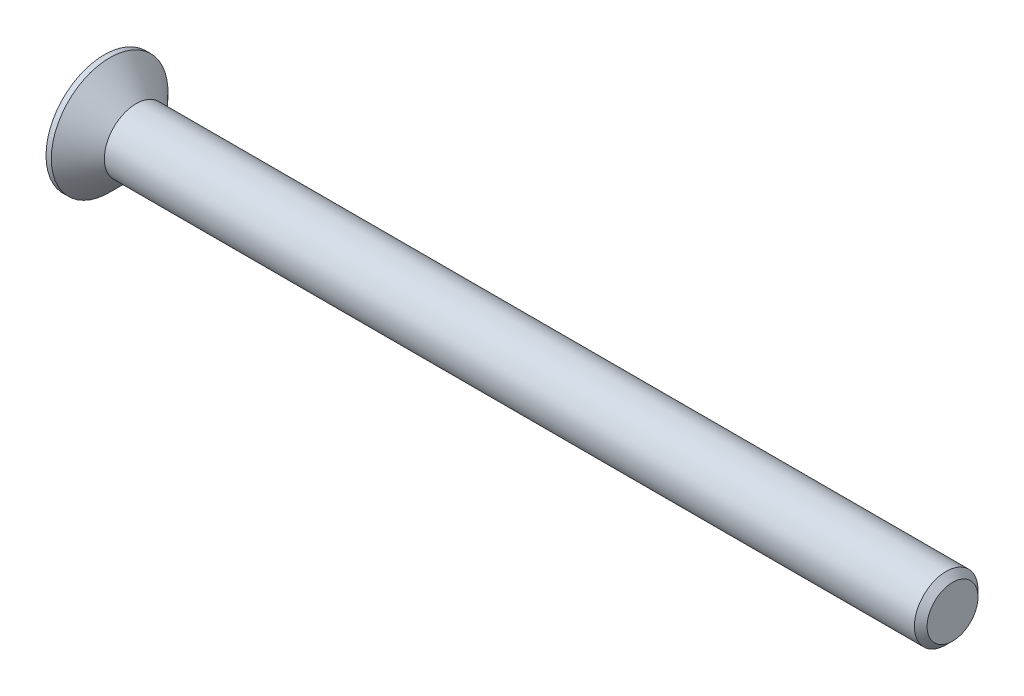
ISO-10303-21;
HEADER;
FILE_DESCRIPTION(('STEP AP214'),'2;1');
FILE_NAME('part.step','',(''),(''),'','','');
FILE_SCHEMA(('AUTOMOTIVE_DESIGN { 1 0 10303 214 1 1 1 1 }'));
ENDSEC;
DATA;
#1=APPLICATION_CONTEXT('core data for automotive mechanical design processes');
#2=APPLICATION_PROTOCOL_DEFINITION('international standard','automotive_design',2000,#1);
#3=PRODUCT_CONTEXT('',#1,'mechanical');
#4=PRODUCT('Part','Part','',(#3));
#5=PRODUCT_RELATED_PRODUCT_CATEGORY('part','',(#4));
#6=PRODUCT_DEFINITION_FORMATION('','',#4);
#7=PRODUCT_DEFINITION_CONTEXT('part definition',#1,'design');
#8=PRODUCT_DEFINITION('design','',#6,#7);
#9=PRODUCT_DEFINITION_SHAPE('','',#8);
#10=(LENGTH_UNIT() NAMED_UNIT(*) SI_UNIT(.MILLI.,.METRE.));
#11=(NAMED_UNIT(*) PLANE_ANGLE_UNIT() SI_UNIT($,.RADIAN.));
#12=(NAMED_UNIT(*) SI_UNIT($,.STERADIAN.) SOLID_ANGLE_UNIT());
#13=UNCERTAINTY_MEASURE_WITH_UNIT(LENGTH_MEASURE(1.E-05),#10,'distance_accuracy_value','');
#14=(GEOMETRIC_REPRESENTATION_CONTEXT(3) GLOBAL_UNCERTAINTY_ASSIGNED_CONTEXT((#13)) GLOBAL_UNIT_ASSIGNED_CONTEXT((#10,
#11,#12)) REPRESENTATION_CONTEXT('',''));
#15=CARTESIAN_POINT('',(0.,0.,0.));
#16=DIRECTION('',(0.,0.,1.));
#17=DIRECTION('',(1.,0.,0.));
#18=AXIS2_PLACEMENT_3D('',#15,#16,#17);
#19=CARTESIAN_POINT('',(0.,0.,0.));
#20=DIRECTION('',(-1.,0.,0.));
#21=DIRECTION('',(0.,0.,1.));
#22=AXIS2_PLACEMENT_3D('',#19,#20,#21);
#23=CONICAL_SURFACE('',#22,3.,0.78539816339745);
#24=CARTESIAN_POINT('',(-2.49999999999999,0.,0.));
#25=DIRECTION('',(-1.,0.,0.));
#26=DIRECTION('',(0.,0.,1.));
#27=AXIS2_PLACEMENT_3D('',#24,#25,#26);
#28=CIRCLE('',#27,5.5);
#29=CARTESIAN_POINT('',(-2.49999999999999,0.,5.5));
#30=VERTEX_POINT('',#29);
#31=EDGE_CURVE('E189',#30,#30,#28,.T.);
#32=ORIENTED_EDGE('',*,*,#31,.F.);
#33=EDGE_LOOP('',(#32));
#34=FACE_BOUND('',#33,.T.);
#35=CARTESIAN_POINT('',(0.,0.,0.));
#36=DIRECTION('',(-1.,0.,0.));
#37=DIRECTION('',(0.,0.,1.));
#38=AXIS2_PLACEMENT_3D('',#35,#36,#37);
#39=CIRCLE('',#38,3.);
#40=CARTESIAN_POINT('',(0.,0.,3.));
#41=VERTEX_POINT('',#40);
#42=EDGE_CURVE('E212',#41,#41,#39,.T.);
#43=ORIENTED_EDGE('',*,*,#42,.T.);
#44=EDGE_LOOP('',(#43));
#45=FACE_BOUND('',#44,.T.);
#46=ADVANCED_FACE('F33',(#34,#45),#23,.T.);
#47=CARTESIAN_POINT('',(-3.,0.,0.));
#48=DIRECTION('',(-1.,0.,0.));
#49=DIRECTION('',(0.,0.,1.));
#50=AXIS2_PLACEMENT_3D('',#47,#48,#49);
#51=CYLINDRICAL_SURFACE('',#50,3.);
#52=CARTESIAN_POINT('',(76.4,0.,0.));
#53=DIRECTION('',(-1.,0.,0.));
#54=DIRECTION('',(0.,0.,1.));
#55=AXIS2_PLACEMENT_3D('',#52,#53,#54);
#56=CIRCLE('',#55,3.);
#57=CARTESIAN_POINT('',(76.4,0.,3.));
#58=VERTEX_POINT('',#57);
#59=EDGE_CURVE('E41',#58,#58,#56,.T.);
#60=ORIENTED_EDGE('',*,*,#59,.T.);
#61=EDGE_LOOP('',(#60));
#62=FACE_BOUND('',#61,.T.);
#63=ORIENTED_EDGE('',*,*,#42,.F.);
#64=EDGE_LOOP('',(#63));
#65=FACE_BOUND('',#64,.T.);
#66=ADVANCED_FACE('F217',(#62,#65),#51,.T.);
#67=CARTESIAN_POINT('',(77.,0.,0.));
#68=DIRECTION('',(-1.,0.,0.));
#69=DIRECTION('',(0.,0.,1.));
#70=AXIS2_PLACEMENT_3D('',#67,#68,#69);
#71=PLANE('',#70);
#72=CARTESIAN_POINT('',(77.,0.,0.));
#73=DIRECTION('',(-1.,0.,0.));
#74=DIRECTION('',(0.,0.,1.));
#75=AXIS2_PLACEMENT_3D('',#72,#73,#74);
#76=CIRCLE('',#75,2.39999999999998);
#77=CARTESIAN_POINT('',(77.,0.,2.39999999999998));
#78=VERTEX_POINT('',#77);
#79=EDGE_CURVE('E11',#78,#78,#76,.F.);
#80=ORIENTED_EDGE('',*,*,#79,.T.);
#81=EDGE_LOOP('',(#80));
#82=FACE_BOUND('',#81,.T.);
#83=ADVANCED_FACE('F239',(#82),#71,.F.);
#84=CARTESIAN_POINT('',(-3.,5.5,0.));
#85=DIRECTION('',(1.,0.,0.));
#86=DIRECTION('',(0.,0.,-1.));
#87=AXIS2_PLACEMENT_3D('',#84,#85,#86);
#88=PLANE('',#87);
#89=DIRECTION('',(0.,0.,-1.));
#90=VECTOR('',#89,1.);
#91=CARTESIAN_POINT('',(-3.,0.825,-3.3));
#92=LINE('',#91,#90);
#93=CARTESIAN_POINT('',(-3.,0.825,-0.825));
#94=VERTEX_POINT('',#93);
#95=CARTESIAN_POINT('',(-3.,0.825,-3.3));
#96=VERTEX_POINT('',#95);
#97=EDGE_CURVE('E158',#94,#96,#92,.T.);
#98=ORIENTED_EDGE('',*,*,#97,.F.);
#99=DIRECTION('',(0.,-1.,0.));
#100=VECTOR('',#99,1.);
#101=CARTESIAN_POINT('',(-3.,0.825,-0.825));
#102=LINE('',#101,#100);
#103=CARTESIAN_POINT('',(-3.,3.3,-0.825));
#104=VERTEX_POINT('',#103);
#105=EDGE_CURVE('E48',#104,#94,#102,.T.);
#106=ORIENTED_EDGE('',*,*,#105,.F.);
#107=DIRECTION('',(0.,0.,-1.));
#108=VECTOR('',#107,1.);
#109=CARTESIAN_POINT('',(-3.,3.3,-0.825));
#110=LINE('',#109,#108);
#111=CARTESIAN_POINT('',(-3.,3.3,0.825));
#112=VERTEX_POINT('',#111);
#113=EDGE_CURVE('E185',#112,#104,#110,.T.);
#114=ORIENTED_EDGE('',*,*,#113,.F.);
#115=DIRECTION('',(0.,1.,0.));
#116=VECTOR('',#115,1.);
#117=CARTESIAN_POINT('',(-3.,3.3,0.825));
#118=LINE('',#117,#116);
#119=CARTESIAN_POINT('',(-3.,0.825,0.825));
#120=VERTEX_POINT('',#119);
#121=EDGE_CURVE('E183',#120,#112,#118,.T.);
#122=ORIENTED_EDGE('',*,*,#121,.F.);
#123=DIRECTION('',(0.,0.,-1.));
#124=VECTOR('',#123,1.);
#125=CARTESIAN_POINT('',(-3.,0.825,0.825));
#126=LINE('',#125,#124);
#127=CARTESIAN_POINT('',(-3.,0.825,3.3));
#128=VERTEX_POINT('',#127);
#129=EDGE_CURVE('E132',#128,#120,#126,.T.);
#130=ORIENTED_EDGE('',*,*,#129,.F.);
#131=DIRECTION('',(0.,1.,0.));
#132=VECTOR('',#131,1.);
#133=CARTESIAN_POINT('',(-3.,0.825,3.3));
#134=LINE('',#133,#132);
#135=CARTESIAN_POINT('',(-3.,-0.825,3.3));
#136=VERTEX_POINT('',#135);
#137=EDGE_CURVE('E179',#136,#128,#134,.T.);
#138=ORIENTED_EDGE('',*,*,#137,.F.);
#139=DIRECTION('',(0.,0.,1.));
#140=VECTOR('',#139,1.);
#141=CARTESIAN_POINT('',(-3.,-0.825,3.3));
#142=LINE('',#141,#140);
#143=CARTESIAN_POINT('',(-3.,-0.825,0.825));
#144=VERTEX_POINT('',#143);
#145=EDGE_CURVE('E176',#144,#136,#142,.T.);
#146=ORIENTED_EDGE('',*,*,#145,.F.);
#147=DIRECTION('',(0.,1.,0.));
#148=VECTOR('',#147,1.);
#149=CARTESIAN_POINT('',(-3.,-0.825,0.825));
#150=LINE('',#149,#148);
#151=CARTESIAN_POINT('',(-3.,-3.3,0.825));
#152=VERTEX_POINT('',#151);
#153=EDGE_CURVE('E173',#152,#144,#150,.T.);
#154=ORIENTED_EDGE('',*,*,#153,.F.);
#155=DIRECTION('',(0.,0.,1.));
#156=VECTOR('',#155,1.);
#157=CARTESIAN_POINT('',(-3.,-3.3,0.825));
#158=LINE('',#157,#156);
#159=CARTESIAN_POINT('',(-3.,-3.3,-0.825));
#160=VERTEX_POINT('',#159);
#161=EDGE_CURVE('E170',#160,#152,#158,.T.);
#162=ORIENTED_EDGE('',*,*,#161,.F.);
#163=DIRECTION('',(0.,-1.,0.));
#164=VECTOR('',#163,1.);
#165=CARTESIAN_POINT('',(-3.,-3.3,-0.825));
#166=LINE('',#165,#164);
#167=CARTESIAN_POINT('',(-3.,-0.825,-0.825));
#168=VERTEX_POINT('',#167);
#169=EDGE_CURVE('E167',#168,#160,#166,.T.);
#170=ORIENTED_EDGE('',*,*,#169,.F.);
#171=DIRECTION('',(0.,0.,1.));
#172=VECTOR('',#171,1.);
#173=CARTESIAN_POINT('',(-3.,-0.825,-0.825));
#174=LINE('',#173,#172);
#175=CARTESIAN_POINT('',(-3.,-0.825,-3.3));
#176=VERTEX_POINT('',#175);
#177=EDGE_CURVE('E164',#176,#168,#174,.T.);
#178=ORIENTED_EDGE('',*,*,#177,.F.);
#179=DIRECTION('',(0.,-1.,0.));
#180=VECTOR('',#179,1.);
#181=CARTESIAN_POINT('',(-3.,-0.825,-3.3));
#182=LINE('',#181,#180);
#183=EDGE_CURVE('E161',#96,#176,#182,.T.);
#184=ORIENTED_EDGE('',*,*,#183,.F.);
#185=EDGE_LOOP('',(#98,#106,#114,#122,#130,#138,#146,#154,#162,#170,#178,#184));
#186=FACE_BOUND('',#185,.T.);
#187=CARTESIAN_POINT('',(-3.,0.,0.));
#188=DIRECTION('',(-1.,0.,0.));
#189=DIRECTION('',(0.,0.,1.));
#190=AXIS2_PLACEMENT_3D('',#187,#188,#189);
#191=CIRCLE('',#190,5.5);
#192=CARTESIAN_POINT('',(-3.,0.,5.5));
#193=VERTEX_POINT('',#192);
#194=EDGE_CURVE('E209',#193,#193,#191,.T.);
#195=ORIENTED_EDGE('',*,*,#194,.T.);
#196=EDGE_LOOP('',(#195));
#197=FACE_BOUND('',#196,.T.);
#198=ADVANCED_FACE('F230',(#186,#197),#88,.F.);
#199=CARTESIAN_POINT('',(-3.,0.,0.));
#200=DIRECTION('',(-1.,0.,0.));
#201=DIRECTION('',(0.,0.,1.));
#202=AXIS2_PLACEMENT_3D('',#199,#200,#201);
#203=CYLINDRICAL_SURFACE('',#202,5.5);
#204=ORIENTED_EDGE('',*,*,#194,.F.);
#205=EDGE_LOOP('',(#204));
#206=FACE_BOUND('',#205,.T.);
#207=ORIENTED_EDGE('',*,*,#31,.T.);
#208=EDGE_LOOP('',(#207));
#209=FACE_BOUND('',#208,.T.);
#210=ADVANCED_FACE('F222',(#206,#209),#203,.T.);
#211=CARTESIAN_POINT('',(76.4,0.,0.));
#212=DIRECTION('',(-1.,0.,0.));
#213=DIRECTION('',(0.,0.,1.));
#214=AXIS2_PLACEMENT_3D('',#211,#212,#213);
#215=CONICAL_SURFACE('',#214,3.,0.78539816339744);
#216=ORIENTED_EDGE('',*,*,#79,.F.);
#217=EDGE_LOOP('',(#216));
#218=FACE_BOUND('',#217,.T.);
#219=ORIENTED_EDGE('',*,*,#59,.F.);
#220=EDGE_LOOP('',(#219));
#221=FACE_BOUND('',#220,.T.);
#222=ADVANCED_FACE('F35',(#218,#221),#215,.T.);
#223=CARTESIAN_POINT('',(-0.5,0.825,-0.825));
#224=DIRECTION('',(0.,0.,-1.));
#225=DIRECTION('',(-1.,0.,0.));
#226=AXIS2_PLACEMENT_3D('',#223,#224,#225);
#227=PLANE('',#226);
#228=ORIENTED_EDGE('',*,*,#105,.T.);
#229=DIRECTION('',(-1.,0.,0.));
#230=VECTOR('',#229,1.);
#231=CARTESIAN_POINT('',(-0.5,0.825,-0.825));
#232=LINE('',#231,#230);
#233=CARTESIAN_POINT('',(-0.5,0.825,-0.825));
#234=VERTEX_POINT('',#233);
#235=EDGE_CURVE('E96',#234,#94,#232,.T.);
#236=ORIENTED_EDGE('',*,*,#235,.F.);
#237=DIRECTION('',(0.,-1.,0.));
#238=VECTOR('',#237,1.);
#239=CARTESIAN_POINT('',(-0.5,0.825,-0.825));
#240=LINE('',#239,#238);
#241=CARTESIAN_POINT('',(-0.5,3.3,-0.825));
#242=VERTEX_POINT('',#241);
#243=EDGE_CURVE('E187',#242,#234,#240,.T.);
#244=ORIENTED_EDGE('',*,*,#243,.F.);
#245=DIRECTION('',(-1.,0.,0.));
#246=VECTOR('',#245,1.);
#247=CARTESIAN_POINT('',(-0.5,3.3,-0.825));
#248=LINE('',#247,#246);
#249=EDGE_CURVE('E56',#242,#104,#248,.T.);
#250=ORIENTED_EDGE('',*,*,#249,.T.);
#251=EDGE_LOOP('',(#228,#236,#244,#250));
#252=FACE_BOUND('',#251,.T.);
#253=ADVANCED_FACE('F221',(#252),#227,.F.);
#254=CARTESIAN_POINT('',(-0.5,3.3,-0.825));
#255=DIRECTION('',(0.,1.,0.));
#256=DIRECTION('',(-1.,0.,0.));
#257=AXIS2_PLACEMENT_3D('',#254,#255,#256);
#258=PLANE('',#257);
#259=ORIENTED_EDGE('',*,*,#113,.T.);
#260=ORIENTED_EDGE('',*,*,#249,.F.);
#261=DIRECTION('',(0.,0.,-1.));
#262=VECTOR('',#261,1.);
#263=CARTESIAN_POINT('',(-0.5,3.3,-0.825));
#264=LINE('',#263,#262);
#265=CARTESIAN_POINT('',(-0.5,3.3,0.825));
#266=VERTEX_POINT('',#265);
#267=EDGE_CURVE('E144',#266,#242,#264,.T.);
#268=ORIENTED_EDGE('',*,*,#267,.F.);
#269=DIRECTION('',(-1.,0.,0.));
#270=VECTOR('',#269,1.);
#271=CARTESIAN_POINT('',(-0.5,3.3,0.825));
#272=LINE('',#271,#270);
#273=EDGE_CURVE('E136',#266,#112,#272,.T.);
#274=ORIENTED_EDGE('',*,*,#273,.T.);
#275=EDGE_LOOP('',(#259,#260,#268,#274));
#276=FACE_BOUND('',#275,.T.);
#277=ADVANCED_FACE('F228',(#276),#258,.F.);
#278=CARTESIAN_POINT('',(-0.5,3.3,0.825));
#279=DIRECTION('',(0.,0.,1.));
#280=DIRECTION('',(1.,0.,0.));
#281=AXIS2_PLACEMENT_3D('',#278,#279,#280);
#282=PLANE('',#281);
#283=ORIENTED_EDGE('',*,*,#121,.T.);
#284=ORIENTED_EDGE('',*,*,#273,.F.);
#285=DIRECTION('',(0.,1.,0.));
#286=VECTOR('',#285,1.);
#287=CARTESIAN_POINT('',(-0.5,3.3,0.825));
#288=LINE('',#287,#286);
#289=CARTESIAN_POINT('',(-0.5,0.825,0.825));
#290=VERTEX_POINT('',#289);
#291=EDGE_CURVE('E140',#290,#266,#288,.T.);
#292=ORIENTED_EDGE('',*,*,#291,.F.);
#293=DIRECTION('',(-1.,0.,0.));
#294=VECTOR('',#293,1.);
#295=CARTESIAN_POINT('',(-0.5,0.825,0.825));
#296=LINE('',#295,#294);
#297=EDGE_CURVE('E125',#290,#120,#296,.T.);
#298=ORIENTED_EDGE('',*,*,#297,.T.);
#299=EDGE_LOOP('',(#283,#284,#292,#298));
#300=FACE_BOUND('',#299,.T.);
#301=ADVANCED_FACE('F141',(#300),#282,.F.);
#302=CARTESIAN_POINT('',(-0.5,0.825,0.825));
#303=DIRECTION('',(0.,1.,0.));
#304=DIRECTION('',(-1.,0.,0.));
#305=AXIS2_PLACEMENT_3D('',#302,#303,#304);
#306=PLANE('',#305);
#307=ORIENTED_EDGE('',*,*,#129,.T.);
#308=ORIENTED_EDGE('',*,*,#297,.F.);
#309=DIRECTION('',(0.,0.,-1.));
#310=VECTOR('',#309,1.);
#311=CARTESIAN_POINT('',(-0.5,0.825,0.825));
#312=LINE('',#311,#310);
#313=CARTESIAN_POINT('',(-0.5,0.825,3.3));
#314=VERTEX_POINT('',#313);
#315=EDGE_CURVE('E129',#314,#290,#312,.T.);
#316=ORIENTED_EDGE('',*,*,#315,.F.);
#317=DIRECTION('',(-1.,0.,0.));
#318=VECTOR('',#317,1.);
#319=CARTESIAN_POINT('',(-0.5,0.825,3.3));
#320=LINE('',#319,#318);
#321=EDGE_CURVE('E137',#314,#128,#320,.T.);
#322=ORIENTED_EDGE('',*,*,#321,.T.);
#323=EDGE_LOOP('',(#307,#308,#316,#322));
#324=FACE_BOUND('',#323,.T.);
#325=ADVANCED_FACE('F127',(#324),#306,.F.);
#326=CARTESIAN_POINT('',(-0.5,0.825,3.3));
#327=DIRECTION('',(0.,0.,1.));
#328=DIRECTION('',(1.,0.,0.));
#329=AXIS2_PLACEMENT_3D('',#326,#327,#328);
#330=PLANE('',#329);
#331=ORIENTED_EDGE('',*,*,#137,.T.);
#332=ORIENTED_EDGE('',*,*,#321,.F.);
#333=DIRECTION('',(0.,1.,0.));
#334=VECTOR('',#333,1.);
#335=CARTESIAN_POINT('',(-0.5,0.825,3.3));
#336=LINE('',#335,#334);
#337=CARTESIAN_POINT('',(-0.5,-0.825,3.3));
#338=VERTEX_POINT('',#337);
#339=EDGE_CURVE('E150',#338,#314,#336,.T.);
#340=ORIENTED_EDGE('',*,*,#339,.F.);
#341=DIRECTION('',(-1.,0.,0.));
#342=VECTOR('',#341,1.);
#343=CARTESIAN_POINT('',(-0.5,-0.825,3.3));
#344=LINE('',#343,#342);
#345=EDGE_CURVE('E192',#338,#136,#344,.T.);
#346=ORIENTED_EDGE('',*,*,#345,.T.);
#347=EDGE_LOOP('',(#331,#332,#340,#346));
#348=FACE_BOUND('',#347,.T.);
#349=ADVANCED_FACE('F277',(#348),#330,.F.);
#350=CARTESIAN_POINT('',(-0.5,-0.825,3.3));
#351=DIRECTION('',(0.,-1.,0.));
#352=DIRECTION('',(1.,0.,0.));
#353=AXIS2_PLACEMENT_3D('',#350,#351,#352);
#354=PLANE('',#353);
#355=ORIENTED_EDGE('',*,*,#145,.T.);
#356=ORIENTED_EDGE('',*,*,#345,.F.);
#357=DIRECTION('',(0.,0.,1.));
#358=VECTOR('',#357,1.);
#359=CARTESIAN_POINT('',(-0.5,-0.825,3.3));
#360=LINE('',#359,#358);
#361=CARTESIAN_POINT('',(-0.5,-0.825,0.825));
#362=VERTEX_POINT('',#361);
#363=EDGE_CURVE('E152',#362,#338,#360,.T.);
#364=ORIENTED_EDGE('',*,*,#363,.F.);
#365=DIRECTION('',(-1.,0.,0.));
#366=VECTOR('',#365,1.);
#367=CARTESIAN_POINT('',(-0.5,-0.825,0.825));
#368=LINE('',#367,#366);
#369=EDGE_CURVE('E194',#362,#144,#368,.T.);
#370=ORIENTED_EDGE('',*,*,#369,.T.);
#371=EDGE_LOOP('',(#355,#356,#364,#370));
#372=FACE_BOUND('',#371,.T.);
#373=ADVANCED_FACE('F273',(#372),#354,.F.);
#374=CARTESIAN_POINT('',(-0.5,-0.825,0.825));
#375=DIRECTION('',(0.,0.,1.));
#376=DIRECTION('',(1.,0.,0.));
#377=AXIS2_PLACEMENT_3D('',#374,#375,#376);
#378=PLANE('',#377);
#379=ORIENTED_EDGE('',*,*,#153,.T.);
#380=ORIENTED_EDGE('',*,*,#369,.F.);
#381=DIRECTION('',(0.,1.,0.));
#382=VECTOR('',#381,1.);
#383=CARTESIAN_POINT('',(-0.5,-0.825,0.825));
#384=LINE('',#383,#382);
#385=CARTESIAN_POINT('',(-0.5,-3.3,0.825));
#386=VERTEX_POINT('',#385);
#387=EDGE_CURVE('E422',#386,#362,#384,.T.);
#388=ORIENTED_EDGE('',*,*,#387,.F.);
#389=DIRECTION('',(-1.,0.,0.));
#390=VECTOR('',#389,1.);
#391=CARTESIAN_POINT('',(-0.5,-3.3,0.825));
#392=LINE('',#391,#390);
#393=EDGE_CURVE('E196',#386,#152,#392,.T.);
#394=ORIENTED_EDGE('',*,*,#393,.T.);
#395=EDGE_LOOP('',(#379,#380,#388,#394));
#396=FACE_BOUND('',#395,.T.);
#397=ADVANCED_FACE('F269',(#396),#378,.F.);
#398=CARTESIAN_POINT('',(-0.5,-3.3,0.825));
#399=DIRECTION('',(0.,-1.,0.));
#400=DIRECTION('',(1.,0.,0.));
#401=AXIS2_PLACEMENT_3D('',#398,#399,#400);
#402=PLANE('',#401);
#403=ORIENTED_EDGE('',*,*,#161,.T.);
#404=ORIENTED_EDGE('',*,*,#393,.F.);
#405=DIRECTION('',(0.,0.,1.));
#406=VECTOR('',#405,1.);
#407=CARTESIAN_POINT('',(-0.5,-3.3,0.825));
#408=LINE('',#407,#406);
#409=CARTESIAN_POINT('',(-0.5,-3.3,-0.825));
#410=VERTEX_POINT('',#409);
#411=EDGE_CURVE('E419',#410,#386,#408,.T.);
#412=ORIENTED_EDGE('',*,*,#411,.F.);
#413=DIRECTION('',(-1.,0.,0.));
#414=VECTOR('',#413,1.);
#415=CARTESIAN_POINT('',(-0.5,-3.3,-0.825));
#416=LINE('',#415,#414);
#417=EDGE_CURVE('E198',#410,#160,#416,.T.);
#418=ORIENTED_EDGE('',*,*,#417,.T.);
#419=EDGE_LOOP('',(#403,#404,#412,#418));
#420=FACE_BOUND('',#419,.T.);
#421=ADVANCED_FACE('F265',(#420),#402,.F.);
#422=CARTESIAN_POINT('',(-0.5,-3.3,-0.825));
#423=DIRECTION('',(0.,0.,-1.));
#424=DIRECTION('',(-1.,0.,0.));
#425=AXIS2_PLACEMENT_3D('',#422,#423,#424);
#426=PLANE('',#425);
#427=ORIENTED_EDGE('',*,*,#169,.T.);
#428=ORIENTED_EDGE('',*,*,#417,.F.);
#429=DIRECTION('',(0.,-1.,0.));
#430=VECTOR('',#429,1.);
#431=CARTESIAN_POINT('',(-0.5,-3.3,-0.825));
#432=LINE('',#431,#430);
#433=CARTESIAN_POINT('',(-0.5,-0.825,-0.825));
#434=VERTEX_POINT('',#433);
#435=EDGE_CURVE('E416',#434,#410,#432,.T.);
#436=ORIENTED_EDGE('',*,*,#435,.F.);
#437=DIRECTION('',(-1.,0.,0.));
#438=VECTOR('',#437,1.);
#439=CARTESIAN_POINT('',(-0.5,-0.825,-0.825));
#440=LINE('',#439,#438);
#441=EDGE_CURVE('E200',#434,#168,#440,.T.);
#442=ORIENTED_EDGE('',*,*,#441,.T.);
#443=EDGE_LOOP('',(#427,#428,#436,#442));
#444=FACE_BOUND('',#443,.T.);
#445=ADVANCED_FACE('F261',(#444),#426,.F.);
#446=CARTESIAN_POINT('',(-0.5,-0.825,-0.825));
#447=DIRECTION('',(0.,-1.,0.));
#448=DIRECTION('',(1.,0.,0.));
#449=AXIS2_PLACEMENT_3D('',#446,#447,#448);
#450=PLANE('',#449);
#451=ORIENTED_EDGE('',*,*,#177,.T.);
#452=ORIENTED_EDGE('',*,*,#441,.F.);
#453=DIRECTION('',(0.,0.,1.));
#454=VECTOR('',#453,1.);
#455=CARTESIAN_POINT('',(-0.5,-0.825,-0.825));
#456=LINE('',#455,#454);
#457=CARTESIAN_POINT('',(-0.5,-0.825,-3.3));
#458=VERTEX_POINT('',#457);
#459=EDGE_CURVE('E413',#458,#434,#456,.T.);
#460=ORIENTED_EDGE('',*,*,#459,.F.);
#461=DIRECTION('',(-1.,0.,0.));
#462=VECTOR('',#461,1.);
#463=CARTESIAN_POINT('',(-0.5,-0.825,-3.3));
#464=LINE('',#463,#462);
#465=EDGE_CURVE('E202',#458,#176,#464,.T.);
#466=ORIENTED_EDGE('',*,*,#465,.T.);
#467=EDGE_LOOP('',(#451,#452,#460,#466));
#468=FACE_BOUND('',#467,.T.);
#469=ADVANCED_FACE('F257',(#468),#450,.F.);
#470=CARTESIAN_POINT('',(-0.5,-0.825,-3.3));
#471=DIRECTION('',(0.,0.,-1.));
#472=DIRECTION('',(-1.,0.,0.));
#473=AXIS2_PLACEMENT_3D('',#470,#471,#472);
#474=PLANE('',#473);
#475=ORIENTED_EDGE('',*,*,#183,.T.);
#476=ORIENTED_EDGE('',*,*,#465,.F.);
#477=DIRECTION('',(0.,-1.,0.));
#478=VECTOR('',#477,1.);
#479=CARTESIAN_POINT('',(-0.5,-0.825,-3.3));
#480=LINE('',#479,#478);
#481=CARTESIAN_POINT('',(-0.5,0.825,-3.3));
#482=VERTEX_POINT('',#481);
#483=EDGE_CURVE('E408',#482,#458,#480,.T.);
#484=ORIENTED_EDGE('',*,*,#483,.F.);
#485=DIRECTION('',(-1.,0.,0.));
#486=VECTOR('',#485,1.);
#487=CARTESIAN_POINT('',(-0.5,0.825,-3.3));
#488=LINE('',#487,#486);
#489=EDGE_CURVE('E204',#482,#96,#488,.T.);
#490=ORIENTED_EDGE('',*,*,#489,.T.);
#491=EDGE_LOOP('',(#475,#476,#484,#490));
#492=FACE_BOUND('',#491,.T.);
#493=ADVANCED_FACE('F253',(#492),#474,.F.);
#494=CARTESIAN_POINT('',(-0.5,0.825,-3.3));
#495=DIRECTION('',(0.,1.,0.));
#496=DIRECTION('',(-1.,0.,0.));
#497=AXIS2_PLACEMENT_3D('',#494,#495,#496);
#498=PLANE('',#497);
#499=ORIENTED_EDGE('',*,*,#97,.T.);
#500=ORIENTED_EDGE('',*,*,#489,.F.);
#501=DIRECTION('',(0.,0.,-1.));
#502=VECTOR('',#501,1.);
#503=CARTESIAN_POINT('',(-0.5,0.825,-3.3));
#504=LINE('',#503,#502);
#505=EDGE_CURVE('E406',#234,#482,#504,.T.);
#506=ORIENTED_EDGE('',*,*,#505,.F.);
#507=ORIENTED_EDGE('',*,*,#235,.T.);
#508=EDGE_LOOP('',(#499,#500,#506,#507));
#509=FACE_BOUND('',#508,.T.);
#510=ADVANCED_FACE('F250',(#509),#498,.F.);
#511=CARTESIAN_POINT('',(-0.5,0.,0.));
#512=DIRECTION('',(1.,0.,0.));
#513=DIRECTION('',(0.,0.,-1.));
#514=AXIS2_PLACEMENT_3D('',#511,#512,#513);
#515=PLANE('',#514);
#516=ORIENTED_EDGE('',*,*,#243,.T.);
#517=ORIENTED_EDGE('',*,*,#505,.T.);
#518=ORIENTED_EDGE('',*,*,#483,.T.);
#519=ORIENTED_EDGE('',*,*,#459,.T.);
#520=ORIENTED_EDGE('',*,*,#435,.T.);
#521=ORIENTED_EDGE('',*,*,#411,.T.);
#522=ORIENTED_EDGE('',*,*,#387,.T.);
#523=ORIENTED_EDGE('',*,*,#363,.T.);
#524=ORIENTED_EDGE('',*,*,#339,.T.);
#525=ORIENTED_EDGE('',*,*,#315,.T.);
#526=ORIENTED_EDGE('',*,*,#291,.T.);
#527=ORIENTED_EDGE('',*,*,#267,.T.);
#528=EDGE_LOOP('',(#516,#517,#518,#519,#520,#521,#522,#523,#524,#525,#526,#527));
#529=FACE_BOUND('',#528,.T.);
#530=ADVANCED_FACE('F147',(#529),#515,.F.);
#531=CLOSED_SHELL('',(#46,#66,#83,#198,#210,#222,#253,#277,#301,#325,#349,#373,#397,#421,#445,
#469,#493,#510,#530));
#532=MANIFOLD_SOLID_BREP('B2',#531);
#533=ADVANCED_BREP_SHAPE_REPRESENTATION('',(#18,#532),#14);
#534=SHAPE_DEFINITION_REPRESENTATION(#9,#533);
ENDSEC;
END-ISO-10303-21;
